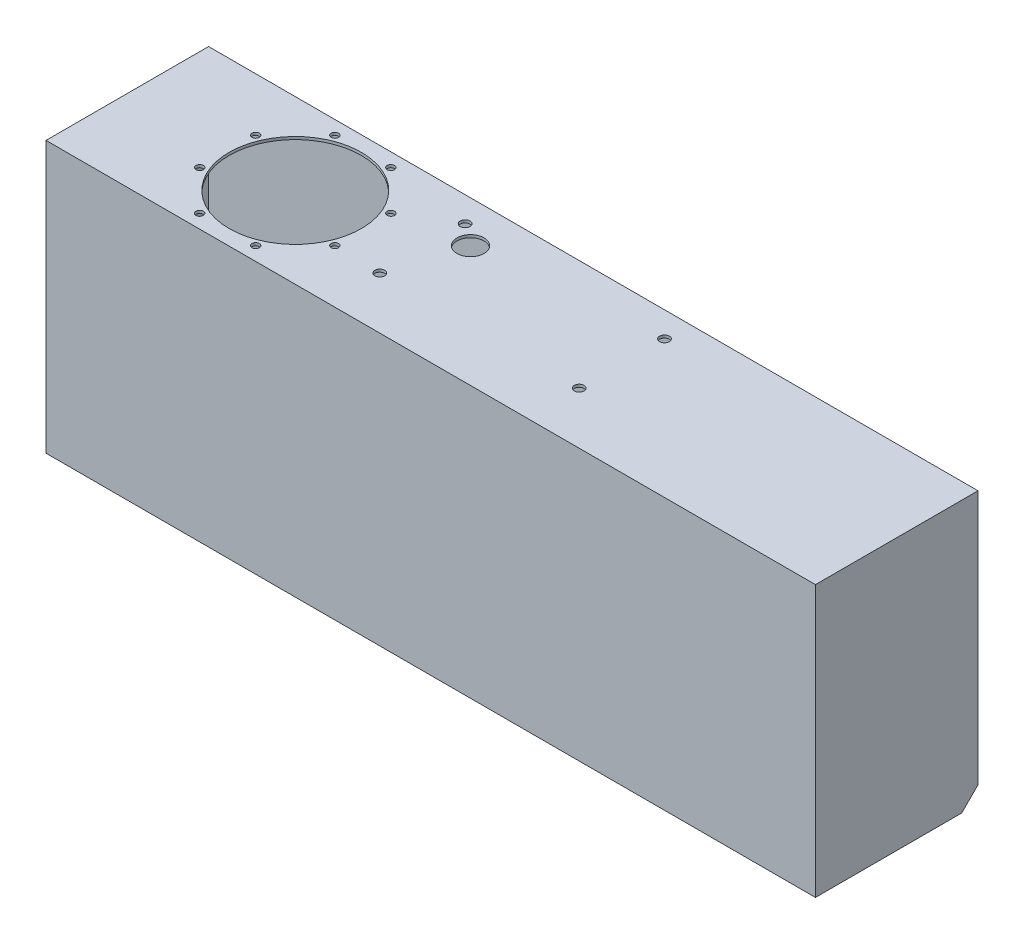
from build123d import *

# Parameters (mm, degrees)
ESQUISSE1_W                  = 710
ESQUISSE1_H                  = 250
EXTRUSION1_DEPTH             = 2.5
ESQUISSE2_W                  = 710
ESQUISSE2_H                  = 250
ESQUISSE2_W_2                = 705
ESQUISSE2_H_2                = 245
EXTRUSION2_DEPTH             = 145
CHANFREIN1_SIZE              = 15
CHANFREIN2_SIZE              = 15
ESQUISSE3_W                  = 710
ESQUISSE3_H                  = 250
EXTRUSION3_DEPTH             = 2.5
ESQUISSE4_R                  = 6.5
ENL_V_MAT_EXTRU_1_DEPTH      = 25
ESQUISSE5_R                  = 61
ESQUISSE5_R_2                = 4.5
ESQUISSE5_R_3                = 12.5
ENL_V_MAT_EXTRU_2_DEPTH      = 25
TROU_TARAUD_M10X1_51_D       = 8.5
TROU_TARAUD_M10X1_51_DEPTH   = 24.5
TROU_TARAUD_M10X1_51_TIP     = 2.553657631
R_P_TITION_CIRCULAIRE1_COUNT = 8


with BuildPart() as part:
    # Esquisse1 → Extrusion1 (new body)
    with BuildSketch(Plane.XY):
        with Locations((355, 125)):
            Rectangle(ESQUISSE1_W, ESQUISSE1_H)
    extrude(amount=EXTRUSION1_DEPTH)

    # Esquisse2 → Extrusion2 (add)
    with BuildSketch(Plane.XY.offset(2.5)):
        with Locations((355, 125)):
            Rectangle(ESQUISSE2_W, ESQUISSE2_H)
        with Locations((355, 125)):
            Rectangle(ESQUISSE2_W_2, ESQUISSE2_H_2, mode=Mode.SUBTRACT)
    extrude(amount=EXTRUSION2_DEPTH)

    # Chanfrein1
    chanfrein1_edges = [part.edges().sort_by_distance(p)[0] for p in [
        (355, 2.5, 2.5),
    ]]
    chamfer(chanfrein1_edges, length=CHANFREIN1_SIZE)

    # Chanfrein2
    chanfrein2_edges = [part.edges().sort_by_distance(p)[0] for p in [
        (355, 0, 0),
    ]]
    chamfer(chanfrein2_edges, length=CHANFREIN2_SIZE)

    # Esquisse3 → Extrusion3 (add)
    with BuildSketch(Plane.XY.offset(147.5)):
        with Locations((355, 125)):
            Rectangle(ESQUISSE3_W, ESQUISSE3_H)
    extrude(amount=EXTRUSION3_DEPTH)

    # Esquisse4 → Enl_v. mat.-Extru.1 (cut)
    with BuildSketch(Plane.XZ):
        with Locations(Location((70, 23, 0), (0, 0, 270))):
            Circle(ESQUISSE4_R)
    extrude(amount=-ENL_V_MAT_EXTRU_1_DEPTH, mode=Mode.SUBTRACT)

    # Esquisse5 → Enl_v. mat.-Extru.2 (cut)
    with BuildSketch(Plane(origin=(0, 250, 0), x_dir=(-1, 0, 0), z_dir=(0, 1, 0))):
        with Locations(Location((-155, 75, 0), (0, 0, 90))):
            Circle(ESQUISSE5_R)
        with Locations(Location((-260, 102, 0), (0, 0, 90))):
            Circle(ESQUISSE5_R_2)
        with Locations(Location((-444, 102, 0), (0, 0, 90))):
            Circle(ESQUISSE5_R_2)
        with Locations(Location((-260, 23.273279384, 0), (0, 0, 90))):
            Circle(ESQUISSE5_R_2)
        with Locations(Location((-444, 23.273279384, 0), (0, 0, 90))):
            Circle(ESQUISSE5_R_2)
        with Locations(Location((-280, 38.273279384, 0), (0, 0, 90))):
            Circle(ESQUISSE5_R_3)
    extrude(amount=-ENL_V_MAT_EXTRU_2_DEPTH, mode=Mode.SUBTRACT)

    # Esquisse6 → Enl_vement de mati_re-R_volution1 (revolve, cut)
    with BuildSketch(Plane(origin=(255, 0, 0), x_dir=(0, 0, -1), z_dir=(1, 0, 0)), mode=Mode.PRIVATE) as enl_vement_de_mati_re_r_volution1_sk:
        Polygon((-59.553532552, 38.312575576), (-31.228863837, -10.747189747), (-15.187105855, -13.532329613), (-48.728215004, 44.562575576), align=None)
    revolve(enl_vement_de_mati_re_r_volution1_sk.sketch.rotate(Axis((255, 0, 23), (0, 0.8660254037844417, 0.49999999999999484)), 236.340497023), axis=Axis((255, 0, 23), (0, 0.8660254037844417, 0.49999999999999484)), mode=Mode.SUBTRACT)

    # Trou taraud_ M10x1.51
    with Locations(Plane.ZY):
        with Locations((120, 220), (120, 144)):
            Hole(TROU_TARAUD_M10X1_51_D / 2, depth=TROU_TARAUD_M10X1_51_DEPTH)
            with Locations((0, 0, -(TROU_TARAUD_M10X1_51_DEPTH + TROU_TARAUD_M10X1_51_TIP / 2))):  # 118° drill point
                Cone(0, TROU_TARAUD_M10X1_51_D / 2, TROU_TARAUD_M10X1_51_TIP, mode=Mode.SUBTRACT)

    # Esquisse10 → Trou taraud_ M8x1.251 (revolve, cut)
    with BuildSketch(Plane(origin=(180.831131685, 250, 12.638131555), x_dir=(0, 0, 1), z_dir=(1, 0, 0))):
        Polygon((0, 0), (0, 21.792926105), (3.4, 19.75), (3.4, 0), align=None)
    trou_taraud_m8x1_251 = revolve(axis=Axis((180.831131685, 256.35, 12.638131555), (0, -1, 0)), mode=Mode.SUBTRACT)

    # R_p_tition circulaire1: Trou taraud_ M8x1.251 ×8 about axis
    r_p_tition_circulaire1_axis = Axis((155, 0, 75), (0, 1, 0))
    for i in range(1, R_P_TITION_CIRCULAIRE1_COUNT):
        add(trou_taraud_m8x1_251.rotate(r_p_tition_circulaire1_axis, i * 360 / R_P_TITION_CIRCULAIRE1_COUNT), mode=Mode.SUBTRACT)


solid = part.part
